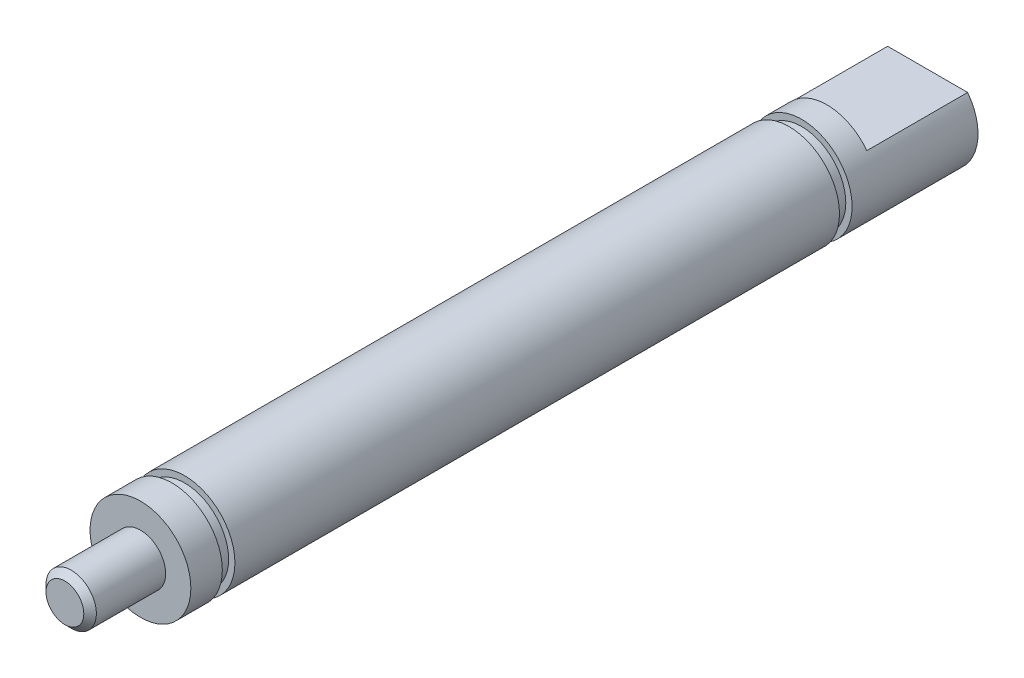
from build123d import *
from build123d.topology import SkipClean

# Parameters (mm, degrees)
BASE_EXTRUSION_DEPTH = 4
ESQUISSE2_R          = 2
BOSS_EXTRU_1_DEPTH   = 1
ESQUISSE3_R          = 1.75
BOSS_EXTRU_2_DEPTH   = 0.5
ESQUISSE4_R          = 2
BOSS_EXTRU_3_DEPTH   = 24
ESQUISSE5_R          = 1.75
BOSS_EXTRU_4_DEPTH   = 0.5
ESQUISSE6_R          = 2
BOSS_EXTRU_5_DEPTH   = 1.25
ESQUISSE7_R          = 1
BOSS_EXTRU_6_DEPTH   = 3
CHANFREIN1_SIZE      = 0.25


with BuildPart() as part:
    # Esquisse1 → Base-Extrusion (new body)
    with BuildSketch(Plane.XY):
        with BuildLine():
            Line((-1.587395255, 1.216624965), (1.587395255, 1.216624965))
            ThreePointArc((1.587395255, 1.216624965), (0, -2), (-1.587395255, 1.216624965))
        make_face()
    extrude(amount=BASE_EXTRUSION_DEPTH)

    # Esquisse2 → Boss.-Extru.1 (add)
    with BuildSketch(Plane.XY.offset(4)):
        Circle(ESQUISSE2_R)
    extrude(amount=BOSS_EXTRU_1_DEPTH)

    # Esquisse3 → Boss.-Extru.2 (add)
    with BuildSketch(Plane.XY.offset(5)):
        Circle(ESQUISSE3_R)
    extrude(amount=BOSS_EXTRU_2_DEPTH)

    # Esquisse4 → Boss.-Extru.3 (add)
    with SkipClean():  # the faces are left unmerged after this step: merging them gives an invalid solid
        with BuildSketch(Plane.XY.offset(5.5)):
            Circle(ESQUISSE4_R)
        extrude(amount=BOSS_EXTRU_3_DEPTH)

    # Esquisse5 → Boss.-Extru.4 (add)
    with SkipClean():  # the faces are left unmerged after this step: merging them gives an invalid solid
        with BuildSketch(Plane.XY.offset(29.5)):
            Circle(ESQUISSE5_R)
        extrude(amount=BOSS_EXTRU_4_DEPTH)

    # Esquisse6 → Boss.-Extru.5 (add)
    with SkipClean():  # the faces are left unmerged after this step: merging them gives an invalid solid
        with BuildSketch(Plane.XY.offset(30)):
            Circle(ESQUISSE6_R)
        extrude(amount=BOSS_EXTRU_5_DEPTH)

    # Esquisse7 → Boss.-Extru.6 (add)
    with SkipClean():  # the faces are left unmerged after this step: merging them gives an invalid solid
        with BuildSketch(Plane.XY.offset(31.25)):
            Circle(ESQUISSE7_R)
        extrude(amount=BOSS_EXTRU_6_DEPTH)

    # Chanfrein1
    chanfrein1_edges = [part.edges().sort_by_distance(p)[0] for p in [
        (-1, 0, 34.25),
    ]]
    chamfer(chanfrein1_edges, length=CHANFREIN1_SIZE)


solid = part.part
